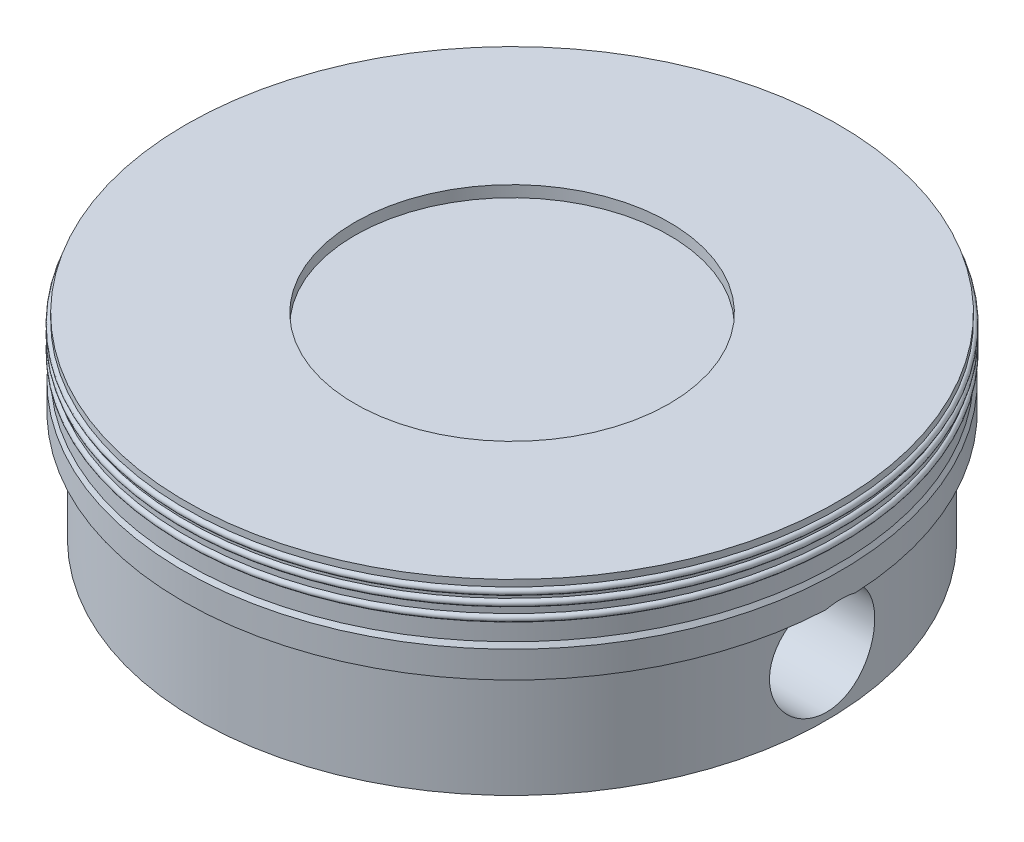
ISO-10303-21;
HEADER;
FILE_DESCRIPTION(('STEP AP214'),'2;1');
FILE_NAME('part.step','',(''),(''),'','','');
FILE_SCHEMA(('AUTOMOTIVE_DESIGN { 1 0 10303 214 1 1 1 1 }'));
ENDSEC;
DATA;
#1=APPLICATION_CONTEXT('core data for automotive mechanical design processes');
#2=APPLICATION_PROTOCOL_DEFINITION('international standard','automotive_design',2000,#1);
#3=PRODUCT_CONTEXT('',#1,'mechanical');
#4=PRODUCT('Part','Part','',(#3));
#5=PRODUCT_RELATED_PRODUCT_CATEGORY('part','',(#4));
#6=PRODUCT_DEFINITION_FORMATION('','',#4);
#7=PRODUCT_DEFINITION_CONTEXT('part definition',#1,'design');
#8=PRODUCT_DEFINITION('design','',#6,#7);
#9=PRODUCT_DEFINITION_SHAPE('','',#8);
#10=(LENGTH_UNIT() NAMED_UNIT(*) SI_UNIT(.MILLI.,.METRE.));
#11=(NAMED_UNIT(*) PLANE_ANGLE_UNIT() SI_UNIT($,.RADIAN.));
#12=(NAMED_UNIT(*) SI_UNIT($,.STERADIAN.) SOLID_ANGLE_UNIT());
#13=UNCERTAINTY_MEASURE_WITH_UNIT(LENGTH_MEASURE(1.E-05),#10,'distance_accuracy_value','');
#14=(GEOMETRIC_REPRESENTATION_CONTEXT(3) GLOBAL_UNCERTAINTY_ASSIGNED_CONTEXT((#13)) GLOBAL_UNIT_ASSIGNED_CONTEXT((#10,
#11,#12)) REPRESENTATION_CONTEXT('',''));
#15=CARTESIAN_POINT('',(0.,0.,0.));
#16=DIRECTION('',(0.,0.,1.));
#17=DIRECTION('',(1.,0.,0.));
#18=AXIS2_PLACEMENT_3D('',#15,#16,#17);
#19=CARTESIAN_POINT('',(0.,1.675,0.));
#20=DIRECTION('',(0.,-1.,0.));
#21=DIRECTION('',(1.,0.,0.));
#22=AXIS2_PLACEMENT_3D('',#19,#20,#21);
#23=PLANE('',#22);
#24=DIRECTION('',(1.,0.,0.));
#25=VECTOR('',#24,1.);
#26=CARTESIAN_POINT('',(-5.01,1.675,-0.222278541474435));
#27=LINE('',#26,#25);
#28=CARTESIAN_POINT('',(-4.99505678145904,1.675,-0.222278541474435));
#29=VERTEX_POINT('',#28);
#30=CARTESIAN_POINT('',(-4.77482902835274,1.675,-0.222278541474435));
#31=VERTEX_POINT('',#30);
#32=EDGE_CURVE('E264',#29,#31,#27,.T.);
#33=ORIENTED_EDGE('',*,*,#32,.F.);
#34=CARTESIAN_POINT('',(0.,1.675,0.));
#35=DIRECTION('',(0.,1.,0.));
#36=DIRECTION('',(-1.,0.,0.));
#37=AXIS2_PLACEMENT_3D('',#34,#35,#36);
#38=CIRCLE('',#37,5.);
#39=CARTESIAN_POINT('',(4.99505678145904,1.675,-0.222278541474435));
#40=VERTEX_POINT('',#39);
#41=EDGE_CURVE('E146',#40,#29,#38,.T.);
#42=ORIENTED_EDGE('',*,*,#41,.F.);
#43=CARTESIAN_POINT('',(4.77482902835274,1.675,-0.222278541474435));
#44=VERTEX_POINT('',#43);
#45=EDGE_CURVE('E60',#44,#40,#27,.T.);
#46=ORIENTED_EDGE('',*,*,#45,.F.);
#47=CARTESIAN_POINT('',(0.,1.675,0.));
#48=DIRECTION('',(0.,1.,0.));
#49=DIRECTION('',(-1.,0.,0.));
#50=AXIS2_PLACEMENT_3D('',#47,#48,#49);
#51=CIRCLE('',#50,4.78);
#52=EDGE_CURVE('E145',#44,#31,#51,.T.);
#53=ORIENTED_EDGE('',*,*,#52,.T.);
#54=EDGE_LOOP('',(#33,#42,#46,#53));
#55=FACE_BOUND('',#54,.T.);
#56=ADVANCED_FACE('F43',(#55),#23,.T.);
#57=CARTESIAN_POINT('',(0.,3.,0.));
#58=DIRECTION('',(0.,1.,0.));
#59=DIRECTION('',(-1.,0.,0.));
#60=AXIS2_PLACEMENT_3D('',#57,#58,#59);
#61=CYLINDRICAL_SURFACE('',#60,3.43);
#62=DIRECTION('',(0.,-1.,0.));
#63=VECTOR('',#62,1.);
#64=CARTESIAN_POINT('',(1.75,2.974,2.94998305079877));
#65=LINE('',#64,#63);
#66=CARTESIAN_POINT('',(1.75,1.93,2.94998305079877));
#67=VERTEX_POINT('',#66);
#68=CARTESIAN_POINT('',(1.75,0.,2.94998305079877));
#69=VERTEX_POINT('',#68);
#70=EDGE_CURVE('E324',#67,#69,#65,.T.);
#71=ORIENTED_EDGE('',*,*,#70,.T.);
#72=CARTESIAN_POINT('',(0.,0.,0.));
#73=DIRECTION('',(0.,1.,0.));
#74=DIRECTION('',(-1.,0.,0.));
#75=AXIS2_PLACEMENT_3D('',#72,#73,#74);
#76=CIRCLE('',#75,3.43);
#77=CARTESIAN_POINT('',(-1.75,0.,2.94998305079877));
#78=VERTEX_POINT('',#77);
#79=EDGE_CURVE('E162',#78,#69,#76,.T.);
#80=ORIENTED_EDGE('',*,*,#79,.F.);
#81=DIRECTION('',(0.,-1.,0.));
#82=VECTOR('',#81,1.);
#83=CARTESIAN_POINT('',(-1.75,2.974,2.94998305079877));
#84=LINE('',#83,#82);
#85=CARTESIAN_POINT('',(-1.75,1.93,2.94998305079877));
#86=VERTEX_POINT('',#85);
#87=EDGE_CURVE('E339',#86,#78,#84,.T.);
#88=ORIENTED_EDGE('',*,*,#87,.F.);
#89=CARTESIAN_POINT('',(0.,1.93,0.));
#90=DIRECTION('',(0.,1.,0.));
#91=DIRECTION('',(-1.,0.,0.));
#92=AXIS2_PLACEMENT_3D('',#89,#90,#91);
#93=CIRCLE('',#92,3.43);
#94=EDGE_CURVE('E167',#86,#67,#93,.T.);
#95=ORIENTED_EDGE('',*,*,#94,.T.);
#96=EDGE_LOOP('',(#71,#80,#88,#95));
#97=FACE_BOUND('',#96,.T.);
#98=ADVANCED_FACE('F212',(#97),#61,.F.);
#99=CARTESIAN_POINT('',(0.,3.,0.));
#100=DIRECTION('',(0.,1.,0.));
#101=DIRECTION('',(-1.,0.,0.));
#102=AXIS2_PLACEMENT_3D('',#99,#100,#101);
#103=CYLINDRICAL_SURFACE('',#102,4.96);
#104=CARTESIAN_POINT('',(0.,2.522,0.));
#105=DIRECTION('',(0.,1.,0.));
#106=DIRECTION('',(-1.,0.,0.));
#107=AXIS2_PLACEMENT_3D('',#104,#105,#106);
#108=CIRCLE('',#107,4.96);
#109=CARTESIAN_POINT('',(-4.96,2.522,0.));
#110=VERTEX_POINT('',#109);
#111=EDGE_CURVE('E362',#110,#110,#108,.T.);
#112=ORIENTED_EDGE('',*,*,#111,.T.);
#113=EDGE_LOOP('',(#112));
#114=FACE_BOUND('',#113,.T.);
#115=CARTESIAN_POINT('',(0.,2.622,0.));
#116=DIRECTION('',(0.,1.,0.));
#117=DIRECTION('',(-1.,0.,0.));
#118=AXIS2_PLACEMENT_3D('',#115,#116,#117);
#119=CIRCLE('',#118,4.96);
#120=CARTESIAN_POINT('',(-4.96,2.622,0.));
#121=VERTEX_POINT('',#120);
#122=EDGE_CURVE('E11',#121,#121,#119,.T.);
#123=ORIENTED_EDGE('',*,*,#122,.F.);
#124=EDGE_LOOP('',(#123));
#125=FACE_BOUND('',#124,.T.);
#126=ADVANCED_FACE('F45',(#114,#125),#103,.T.);
#127=CARTESIAN_POINT('',(0.,2.672,0.));
#128=DIRECTION('',(0.,1.,0.));
#129=DIRECTION('',(-1.,0.,0.));
#130=AXIS2_PLACEMENT_3D('',#127,#128,#129);
#131=TOROIDAL_SURFACE('',#130,4.96,0.0500000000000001);
#132=CARTESIAN_POINT('',(0.,2.722,0.));
#133=DIRECTION('',(0.,1.,0.));
#134=DIRECTION('',(-1.,0.,0.));
#135=AXIS2_PLACEMENT_3D('',#132,#133,#134);
#136=CIRCLE('',#135,4.96);
#137=CARTESIAN_POINT('',(-4.96,2.722,0.));
#138=VERTEX_POINT('',#137);
#139=EDGE_CURVE('E53',#138,#138,#136,.T.);
#140=ORIENTED_EDGE('',*,*,#139,.F.);
#141=EDGE_LOOP('',(#140));
#142=FACE_BOUND('',#141,.T.);
#143=ORIENTED_EDGE('',*,*,#122,.T.);
#144=EDGE_LOOP('',(#143));
#145=FACE_BOUND('',#144,.T.);
#146=ADVANCED_FACE('F206',(#142,#145),#131,.T.);
#147=CARTESIAN_POINT('',(0.,3.,0.));
#148=DIRECTION('',(0.,1.,0.));
#149=DIRECTION('',(-1.,0.,0.));
#150=AXIS2_PLACEMENT_3D('',#147,#148,#149);
#151=CYLINDRICAL_SURFACE('',#150,4.96);
#152=ORIENTED_EDGE('',*,*,#139,.T.);
#153=EDGE_LOOP('',(#152));
#154=FACE_BOUND('',#153,.T.);
#155=CARTESIAN_POINT('',(0.,2.772,0.));
#156=DIRECTION('',(0.,1.,0.));
#157=DIRECTION('',(-1.,0.,0.));
#158=AXIS2_PLACEMENT_3D('',#155,#156,#157);
#159=CIRCLE('',#158,4.96);
#160=CARTESIAN_POINT('',(-4.96,2.772,0.));
#161=VERTEX_POINT('',#160);
#162=EDGE_CURVE('E195',#161,#161,#159,.T.);
#163=ORIENTED_EDGE('',*,*,#162,.F.);
#164=EDGE_LOOP('',(#163));
#165=FACE_BOUND('',#164,.T.);
#166=ADVANCED_FACE('F203',(#154,#165),#151,.T.);
#167=CARTESIAN_POINT('',(0.,2.822,0.));
#168=DIRECTION('',(0.,1.,0.));
#169=DIRECTION('',(-1.,0.,0.));
#170=AXIS2_PLACEMENT_3D('',#167,#168,#169);
#171=TOROIDAL_SURFACE('',#170,4.96,0.0500000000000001);
#172=CARTESIAN_POINT('',(0.,2.872,0.));
#173=DIRECTION('',(0.,1.,0.));
#174=DIRECTION('',(-1.,0.,0.));
#175=AXIS2_PLACEMENT_3D('',#172,#173,#174);
#176=CIRCLE('',#175,4.96);
#177=CARTESIAN_POINT('',(-4.96,2.872,0.));
#178=VERTEX_POINT('',#177);
#179=EDGE_CURVE('E191',#178,#178,#176,.T.);
#180=ORIENTED_EDGE('',*,*,#179,.F.);
#181=EDGE_LOOP('',(#180));
#182=FACE_BOUND('',#181,.T.);
#183=ORIENTED_EDGE('',*,*,#162,.T.);
#184=EDGE_LOOP('',(#183));
#185=FACE_BOUND('',#184,.T.);
#186=ADVANCED_FACE('F426',(#182,#185),#171,.T.);
#187=CARTESIAN_POINT('',(0.,3.,0.));
#188=DIRECTION('',(0.,1.,0.));
#189=DIRECTION('',(-1.,0.,0.));
#190=AXIS2_PLACEMENT_3D('',#187,#188,#189);
#191=CYLINDRICAL_SURFACE('',#190,4.96);
#192=ORIENTED_EDGE('',*,*,#179,.T.);
#193=EDGE_LOOP('',(#192));
#194=FACE_BOUND('',#193,.T.);
#195=CARTESIAN_POINT('',(0.,2.972,0.));
#196=DIRECTION('',(0.,1.,0.));
#197=DIRECTION('',(-1.,0.,0.));
#198=AXIS2_PLACEMENT_3D('',#195,#196,#197);
#199=CIRCLE('',#198,4.96);
#200=CARTESIAN_POINT('',(-4.96,2.972,0.));
#201=VERTEX_POINT('',#200);
#202=EDGE_CURVE('E187',#201,#201,#199,.T.);
#203=ORIENTED_EDGE('',*,*,#202,.F.);
#204=EDGE_LOOP('',(#203));
#205=FACE_BOUND('',#204,.T.);
#206=ADVANCED_FACE('F422',(#194,#205),#191,.T.);
#207=CARTESIAN_POINT('',(0.,2.972,0.));
#208=DIRECTION('',(0.,1.,0.));
#209=DIRECTION('',(-1.,0.,0.));
#210=AXIS2_PLACEMENT_3D('',#207,#208,#209);
#211=PLANE('',#210);
#212=ORIENTED_EDGE('',*,*,#202,.T.);
#213=EDGE_LOOP('',(#212));
#214=FACE_BOUND('',#213,.T.);
#215=CARTESIAN_POINT('',(0.,2.972,0.));
#216=DIRECTION('',(0.,1.,0.));
#217=DIRECTION('',(-1.,0.,0.));
#218=AXIS2_PLACEMENT_3D('',#215,#216,#217);
#219=CIRCLE('',#218,2.39);
#220=CARTESIAN_POINT('',(-2.39,2.972,0.));
#221=VERTEX_POINT('',#220);
#222=EDGE_CURVE('E183',#221,#221,#219,.T.);
#223=ORIENTED_EDGE('',*,*,#222,.F.);
#224=EDGE_LOOP('',(#223));
#225=FACE_BOUND('',#224,.T.);
#226=ADVANCED_FACE('F418',(#214,#225),#211,.T.);
#227=CARTESIAN_POINT('',(0.,3.,0.));
#228=DIRECTION('',(0.,1.,0.));
#229=DIRECTION('',(-1.,0.,0.));
#230=AXIS2_PLACEMENT_3D('',#227,#228,#229);
#231=CYLINDRICAL_SURFACE('',#230,2.39);
#232=ORIENTED_EDGE('',*,*,#222,.T.);
#233=EDGE_LOOP('',(#232));
#234=FACE_BOUND('',#233,.T.);
#235=CARTESIAN_POINT('',(0.,2.8,0.));
#236=DIRECTION('',(0.,1.,0.));
#237=DIRECTION('',(-1.,0.,0.));
#238=AXIS2_PLACEMENT_3D('',#235,#236,#237);
#239=CIRCLE('',#238,2.39);
#240=CARTESIAN_POINT('',(-2.39,2.8,0.));
#241=VERTEX_POINT('',#240);
#242=EDGE_CURVE('E179',#241,#241,#239,.T.);
#243=ORIENTED_EDGE('',*,*,#242,.F.);
#244=EDGE_LOOP('',(#243));
#245=FACE_BOUND('',#244,.T.);
#246=ADVANCED_FACE('F414',(#234,#245),#231,.F.);
#247=CARTESIAN_POINT('',(0.,2.8,0.));
#248=DIRECTION('',(0.,1.,0.));
#249=DIRECTION('',(-1.,0.,0.));
#250=AXIS2_PLACEMENT_3D('',#247,#248,#249);
#251=PLANE('',#250);
#252=ORIENTED_EDGE('',*,*,#242,.T.);
#253=EDGE_LOOP('',(#252));
#254=FACE_BOUND('',#253,.T.);
#255=ADVANCED_FACE('F396',(#254),#251,.T.);
#256=CARTESIAN_POINT('',(0.,2.33,0.));
#257=DIRECTION('',(0.,-1.,0.));
#258=DIRECTION('',(1.,0.,0.));
#259=AXIS2_PLACEMENT_3D('',#256,#257,#258);
#260=PLANE('',#259);
#261=CARTESIAN_POINT('',(0.,2.33,0.));
#262=DIRECTION('',(0.,-1.,0.));
#263=DIRECTION('',(1.,0.,0.));
#264=AXIS2_PLACEMENT_3D('',#261,#262,#263);
#265=CIRCLE('',#264,3.43);
#266=CARTESIAN_POINT('',(1.75,2.33,2.94998305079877));
#267=VERTEX_POINT('',#266);
#268=CARTESIAN_POINT('',(1.75,2.33,-2.94998305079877));
#269=VERTEX_POINT('',#268);
#270=EDGE_CURVE('E320',#267,#269,#265,.F.);
#271=ORIENTED_EDGE('',*,*,#270,.T.);
#272=DIRECTION('',(0.,0.,1.));
#273=VECTOR('',#272,1.);
#274=CARTESIAN_POINT('',(1.75,2.33,2.94998305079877));
#275=LINE('',#274,#273);
#276=EDGE_CURVE('E333',#269,#267,#275,.T.);
#277=ORIENTED_EDGE('',*,*,#276,.T.);
#278=EDGE_LOOP('',(#271,#277));
#279=FACE_BOUND('',#278,.T.);
#280=CARTESIAN_POINT('',(0.,2.33,0.));
#281=DIRECTION('',(0.,-1.,0.));
#282=DIRECTION('',(1.,0.,0.));
#283=AXIS2_PLACEMENT_3D('',#280,#281,#282);
#284=CIRCLE('',#283,3.43);
#285=CARTESIAN_POINT('',(-1.75,2.33,-2.94998305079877));
#286=VERTEX_POINT('',#285);
#287=CARTESIAN_POINT('',(-1.75,2.33,2.94998305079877));
#288=VERTEX_POINT('',#287);
#289=EDGE_CURVE('E357',#286,#288,#284,.F.);
#290=ORIENTED_EDGE('',*,*,#289,.T.);
#291=DIRECTION('',(0.,0.,-1.));
#292=VECTOR('',#291,1.);
#293=CARTESIAN_POINT('',(-1.75,2.33,2.94998305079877));
#294=LINE('',#293,#292);
#295=EDGE_CURVE('E353',#288,#286,#294,.T.);
#296=ORIENTED_EDGE('',*,*,#295,.T.);
#297=EDGE_LOOP('',(#290,#296));
#298=FACE_BOUND('',#297,.T.);
#299=CARTESIAN_POINT('',(0.,2.33,0.));
#300=DIRECTION('',(0.,1.,0.));
#301=DIRECTION('',(-1.,0.,0.));
#302=AXIS2_PLACEMENT_3D('',#299,#300,#301);
#303=CIRCLE('',#302,4.2);
#304=CARTESIAN_POINT('',(-4.2,2.33,0.));
#305=VERTEX_POINT('',#304);
#306=EDGE_CURVE('E175',#305,#305,#303,.T.);
#307=ORIENTED_EDGE('',*,*,#306,.F.);
#308=EDGE_LOOP('',(#307));
#309=FACE_BOUND('',#308,.T.);
#310=ADVANCED_FACE('F392',(#279,#298,#309),#260,.T.);
#311=CARTESIAN_POINT('',(0.,3.,0.));
#312=DIRECTION('',(0.,1.,0.));
#313=DIRECTION('',(-1.,0.,0.));
#314=AXIS2_PLACEMENT_3D('',#311,#312,#313);
#315=CYLINDRICAL_SURFACE('',#314,4.2);
#316=ORIENTED_EDGE('',*,*,#306,.T.);
#317=EDGE_LOOP('',(#316));
#318=FACE_BOUND('',#317,.T.);
#319=CARTESIAN_POINT('',(0.,1.93,0.));
#320=DIRECTION('',(0.,1.,0.));
#321=DIRECTION('',(-1.,0.,0.));
#322=AXIS2_PLACEMENT_3D('',#319,#320,#321);
#323=CIRCLE('',#322,4.2);
#324=CARTESIAN_POINT('',(-4.2,1.93,0.));
#325=VERTEX_POINT('',#324);
#326=EDGE_CURVE('E171',#325,#325,#323,.T.);
#327=ORIENTED_EDGE('',*,*,#326,.F.);
#328=EDGE_LOOP('',(#327));
#329=FACE_BOUND('',#328,.T.);
#330=ADVANCED_FACE('F395',(#318,#329),#315,.F.);
#331=CARTESIAN_POINT('',(0.,1.93,0.));
#332=DIRECTION('',(0.,1.,0.));
#333=DIRECTION('',(-1.,0.,0.));
#334=AXIS2_PLACEMENT_3D('',#331,#332,#333);
#335=PLANE('',#334);
#336=ORIENTED_EDGE('',*,*,#326,.T.);
#337=EDGE_LOOP('',(#336));
#338=FACE_BOUND('',#337,.T.);
#339=ORIENTED_EDGE('',*,*,#94,.F.);
#340=CARTESIAN_POINT('',(0.,1.93,0.));
#341=DIRECTION('',(0.,1.,0.));
#342=DIRECTION('',(-1.,0.,0.));
#343=AXIS2_PLACEMENT_3D('',#340,#341,#342);
#344=CIRCLE('',#343,3.43);
#345=CARTESIAN_POINT('',(-1.75,1.93,-2.94998305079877));
#346=VERTEX_POINT('',#345);
#347=EDGE_CURVE('E356',#346,#86,#344,.T.);
#348=ORIENTED_EDGE('',*,*,#347,.F.);
#349=CARTESIAN_POINT('',(1.75,1.93,-2.94998305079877));
#350=VERTEX_POINT('',#349);
#351=EDGE_CURVE('E166',#350,#346,#93,.T.);
#352=ORIENTED_EDGE('',*,*,#351,.F.);
#353=CARTESIAN_POINT('',(0.,1.93,0.));
#354=DIRECTION('',(0.,1.,0.));
#355=DIRECTION('',(-1.,0.,0.));
#356=AXIS2_PLACEMENT_3D('',#353,#354,#355);
#357=CIRCLE('',#356,3.43);
#358=EDGE_CURVE('E318',#67,#350,#357,.T.);
#359=ORIENTED_EDGE('',*,*,#358,.F.);
#360=EDGE_LOOP('',(#339,#348,#352,#359));
#361=FACE_BOUND('',#360,.T.);
#362=ADVANCED_FACE('F329',(#338,#361),#335,.T.);
#363=DIRECTION('',(0.,-1.,0.));
#364=VECTOR('',#363,1.);
#365=CARTESIAN_POINT('',(1.75,2.974,-2.94998305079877));
#366=LINE('',#365,#364);
#367=CARTESIAN_POINT('',(1.75,0.,-2.94998305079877));
#368=VERTEX_POINT('',#367);
#369=EDGE_CURVE('E561',#350,#368,#366,.T.);
#370=ORIENTED_EDGE('',*,*,#369,.F.);
#371=ORIENTED_EDGE('',*,*,#351,.T.);
#372=DIRECTION('',(0.,-1.,0.));
#373=VECTOR('',#372,1.);
#374=CARTESIAN_POINT('',(-1.75,2.974,-2.94998305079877));
#375=LINE('',#374,#373);
#376=CARTESIAN_POINT('',(-1.75,0.,-2.94998305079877));
#377=VERTEX_POINT('',#376);
#378=EDGE_CURVE('E348',#346,#377,#375,.T.);
#379=ORIENTED_EDGE('',*,*,#378,.T.);
#380=EDGE_CURVE('E161',#368,#377,#76,.T.);
#381=ORIENTED_EDGE('',*,*,#380,.F.);
#382=EDGE_LOOP('',(#370,#371,#379,#381));
#383=FACE_BOUND('',#382,.T.);
#384=ADVANCED_FACE('F219',(#383),#61,.F.);
#385=CARTESIAN_POINT('',(0.,0.,0.));
#386=DIRECTION('',(0.,-1.,0.));
#387=DIRECTION('',(1.,0.,0.));
#388=AXIS2_PLACEMENT_3D('',#385,#386,#387);
#389=PLANE('',#388);
#390=ORIENTED_EDGE('',*,*,#79,.T.);
#391=DIRECTION('',(0.,0.,-1.));
#392=VECTOR('',#391,1.);
#393=CARTESIAN_POINT('',(1.75,0.,2.94998305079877));
#394=LINE('',#393,#392);
#395=EDGE_CURVE('E263',#69,#368,#394,.T.);
#396=ORIENTED_EDGE('',*,*,#395,.T.);
#397=ORIENTED_EDGE('',*,*,#380,.T.);
#398=DIRECTION('',(0.,0.,1.));
#399=VECTOR('',#398,1.);
#400=CARTESIAN_POINT('',(-1.75,0.,2.94998305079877));
#401=LINE('',#400,#399);
#402=EDGE_CURVE('E332',#377,#78,#401,.T.);
#403=ORIENTED_EDGE('',*,*,#402,.T.);
#404=EDGE_LOOP('',(#390,#396,#397,#403));
#405=FACE_BOUND('',#404,.T.);
#406=CARTESIAN_POINT('',(0.,0.,0.));
#407=DIRECTION('',(0.,1.,0.));
#408=DIRECTION('',(-1.,0.,0.));
#409=AXIS2_PLACEMENT_3D('',#406,#407,#408);
#410=CIRCLE('',#409,4.78);
#411=CARTESIAN_POINT('',(-4.78,0.,0.));
#412=VERTEX_POINT('',#411);
#413=EDGE_CURVE('E157',#412,#412,#410,.T.);
#414=ORIENTED_EDGE('',*,*,#413,.F.);
#415=EDGE_LOOP('',(#414));
#416=FACE_BOUND('',#415,.T.);
#417=ADVANCED_FACE('F236',(#405,#416),#389,.T.);
#418=CARTESIAN_POINT('',(0.,3.,0.));
#419=DIRECTION('',(0.,1.,0.));
#420=DIRECTION('',(-1.,0.,0.));
#421=AXIS2_PLACEMENT_3D('',#418,#419,#420);
#422=CYLINDRICAL_SURFACE('',#421,4.78);
#423=CARTESIAN_POINT('',(4.77482902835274,1.675,0.222278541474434));
#424=CARTESIAN_POINT('',(4.77283066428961,1.66251760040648,0.265565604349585));
#425=CARTESIAN_POINT('',(4.77026122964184,1.64632518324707,0.307730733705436));
#426=CARTESIAN_POINT('',(4.76433957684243,1.60716518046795,0.3886797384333));
#427=CARTESIAN_POINT('',(4.76098813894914,1.58420434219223,0.427466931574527));
#428=CARTESIAN_POINT('',(4.75385583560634,1.53212058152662,0.500619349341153));
#429=CARTESIAN_POINT('',(4.75007489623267,1.50299659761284,0.534983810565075));
#430=CARTESIAN_POINT('',(4.74250940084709,1.43940883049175,0.598349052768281));
#431=CARTESIAN_POINT('',(4.73872484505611,1.40494535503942,0.627350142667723));
#432=CARTESIAN_POINT('',(4.73155502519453,1.33141850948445,0.679324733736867));
#433=CARTESIAN_POINT('',(4.72817200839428,1.2923314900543,0.702265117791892));
#434=CARTESIAN_POINT('',(4.72221806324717,1.21079350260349,0.74124709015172));
#435=CARTESIAN_POINT('',(4.71964718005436,1.16834234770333,0.757288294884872));
#436=CARTESIAN_POINT('',(4.71563401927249,1.08161467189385,0.781889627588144));
#437=CARTESIAN_POINT('',(4.71418348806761,1.03735407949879,0.79050452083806));
#438=CARTESIAN_POINT('',(4.7125500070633,0.947995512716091,0.80018577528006));
#439=CARTESIAN_POINT('',(4.71236689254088,0.902897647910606,0.801253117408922));
#440=CARTESIAN_POINT('',(4.71328392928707,0.813698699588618,0.79584005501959));
#441=CARTESIAN_POINT('',(4.71436921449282,0.769592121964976,0.789447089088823));
#442=CARTESIAN_POINT('',(4.71767350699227,0.683088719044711,0.76945319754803));
#443=CARTESIAN_POINT('',(4.71989255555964,0.640691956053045,0.755852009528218));
#444=CARTESIAN_POINT('',(4.72521915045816,0.558683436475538,0.721803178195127));
#445=CARTESIAN_POINT('',(4.7283288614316,0.519078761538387,0.701338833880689));
#446=CARTESIAN_POINT('',(4.73508688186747,0.443840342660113,0.654154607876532));
#447=CARTESIAN_POINT('',(4.73873523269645,0.408206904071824,0.627434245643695));
#448=CARTESIAN_POINT('',(4.74621658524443,0.341444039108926,0.568094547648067));
#449=CARTESIAN_POINT('',(4.75005134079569,0.310377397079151,0.535404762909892));
#450=CARTESIAN_POINT('',(4.7574339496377,0.254152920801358,0.465256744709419));
#451=CARTESIAN_POINT('',(4.76098179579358,0.228995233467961,0.427798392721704));
#452=CARTESIAN_POINT('',(4.76740543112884,0.185232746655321,0.34901358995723));
#453=CARTESIAN_POINT('',(4.77027898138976,0.166649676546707,0.307674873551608));
#454=CARTESIAN_POINT('',(4.77501389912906,0.136709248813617,0.222404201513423));
#455=CARTESIAN_POINT('',(4.77687534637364,0.125351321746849,0.178472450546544));
#456=CARTESIAN_POINT('',(4.77936046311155,0.11029556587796,0.089776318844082));
#457=CARTESIAN_POINT('',(4.77999744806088,0.106515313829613,0.0450263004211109));
#458=CARTESIAN_POINT('',(4.78000253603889,0.106484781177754,-0.0444748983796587));
#459=CARTESIAN_POINT('',(4.77937070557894,0.110234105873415,-0.0892260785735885));
#460=CARTESIAN_POINT('',(4.77691933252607,0.125084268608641,-0.177083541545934));
#461=CARTESIAN_POINT('',(4.77510939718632,0.136125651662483,-0.220200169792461));
#462=CARTESIAN_POINT('',(4.77051005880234,0.165169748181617,-0.303965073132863));
#463=CARTESIAN_POINT('',(4.7677206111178,0.183172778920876,-0.344613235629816));
#464=CARTESIAN_POINT('',(4.76144347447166,0.225773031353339,-0.422610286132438));
#465=CARTESIAN_POINT('',(4.7579509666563,0.250416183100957,-0.459933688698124));
#466=CARTESIAN_POINT('',(4.75066285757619,0.305548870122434,-0.529946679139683));
#467=CARTESIAN_POINT('',(4.74686723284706,0.336038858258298,-0.562635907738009));
#468=CARTESIAN_POINT('',(4.73934595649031,0.402419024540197,-0.622842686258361));
#469=CARTESIAN_POINT('',(4.73562161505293,0.438367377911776,-0.650296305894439));
#470=CARTESIAN_POINT('',(4.72871063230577,0.514408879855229,-0.698783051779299));
#471=CARTESIAN_POINT('',(4.7255239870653,0.554501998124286,-0.719816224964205));
#472=CARTESIAN_POINT('',(4.72006047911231,0.637638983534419,-0.7548139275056));
#473=CARTESIAN_POINT('',(4.71778200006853,0.680677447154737,-0.768791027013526));
#474=CARTESIAN_POINT('',(4.71439384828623,0.768535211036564,-0.789303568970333));
#475=CARTESIAN_POINT('',(4.71328404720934,0.81335431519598,-0.795839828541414));
#476=CARTESIAN_POINT('',(4.71237032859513,0.902894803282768,-0.801232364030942));
#477=CARTESIAN_POINT('',(4.71255007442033,0.947610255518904,-0.800184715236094));
#478=CARTESIAN_POINT('',(4.71415581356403,1.03622268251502,-0.79066917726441));
#479=CARTESIAN_POINT('',(4.71558184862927,1.08011962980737,-0.782201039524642));
#480=CARTESIAN_POINT('',(4.7195083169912,1.16569262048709,-0.758147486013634));
#481=CARTESIAN_POINT('',(4.72200485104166,1.20737611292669,-0.742587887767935));
#482=CARTESIAN_POINT('',(4.72778974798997,1.28754614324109,-0.704817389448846));
#483=CARTESIAN_POINT('',(4.73107806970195,1.32603284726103,-0.682606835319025));
#484=CARTESIAN_POINT('',(4.73812137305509,1.39918330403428,-0.631874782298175));
#485=CARTESIAN_POINT('',(4.74188110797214,1.43380013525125,-0.603286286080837));
#486=CARTESIAN_POINT('',(4.7494215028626,1.49778166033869,-0.540730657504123));
#487=CARTESIAN_POINT('',(4.75320216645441,1.52714541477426,-0.50676256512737));
#488=CARTESIAN_POINT('',(4.76047823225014,1.58065809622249,-0.433176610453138));
#489=CARTESIAN_POINT('',(4.76396027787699,1.6046052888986,-0.393410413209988));
#490=CARTESIAN_POINT('',(4.77010780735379,1.64535476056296,-0.310255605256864));
#491=CARTESIAN_POINT('',(4.77277226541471,1.66214807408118,-0.266862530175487));
#492=CARTESIAN_POINT('',(4.77482902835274,1.675,-0.222278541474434));
#493=B_SPLINE_CURVE_WITH_KNOTS('',3,(#423,#424,#425,#426,#427,#428,#429,#430,#431,#432,#433,
#434,#435,#436,#437,#438,#439,#440,#441,#442,#443,#444,#445,#446,#447,#448,#449,#450,#451,#452,
#453,#454,#455,#456,#457,#458,#459,#460,#461,#462,#463,#464,#465,#466,#467,#468,#469,#470,#471,
#472,#473,#474,#475,#476,#477,#478,#479,#480,#481,#482,#483,#484,#485,#486,#487,#488,#489,#490,
#491,#492),.UNSPECIFIED.,.F.,.F.,(4,2,2,2,2,2,2,2,2,2,2,2,2,2,2,2,2,2,2,2,2,2,2,2,2,2,2,2,2,2,2,
2,2,2,4),(0.,0.135088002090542,0.2700417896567,0.405018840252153,0.539988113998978,
0.675680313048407,0.81138005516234,0.946070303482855,1.08074304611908,1.21385307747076,
1.34696795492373,1.48040913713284,1.61386057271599,1.74900279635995,1.88414837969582,
2.01973654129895,2.15531401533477,2.28940861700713,2.42349618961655,2.55650377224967,
2.68951741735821,2.82347585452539,2.95744467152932,3.09295713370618,3.22846860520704,
3.36373780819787,3.49899215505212,3.63253608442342,3.76608448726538,3.89915052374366,
4.032209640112,4.16673845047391,4.30129129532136,4.44024045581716,4.5793632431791),.UNSPECIFIED.);
#494=CARTESIAN_POINT('',(4.77482902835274,1.675,0.222278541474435));
#495=VERTEX_POINT('',#494);
#496=EDGE_CURVE('E247',#495,#44,#493,.T.);
#497=ORIENTED_EDGE('',*,*,#496,.F.);
#498=CARTESIAN_POINT('',(-4.77482902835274,1.675,0.222278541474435));
#499=VERTEX_POINT('',#498);
#500=EDGE_CURVE('E138',#499,#495,#51,.T.);
#501=ORIENTED_EDGE('',*,*,#500,.F.);
#502=CARTESIAN_POINT('',(-4.77482902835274,1.675,-0.222278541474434));
#503=CARTESIAN_POINT('',(-4.77283066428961,1.66251760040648,-0.265565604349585));
#504=CARTESIAN_POINT('',(-4.77026122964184,1.64632518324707,-0.307730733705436));
#505=CARTESIAN_POINT('',(-4.76433957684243,1.60716518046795,-0.3886797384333));
#506=CARTESIAN_POINT('',(-4.76098813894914,1.58420434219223,-0.427466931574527));
#507=CARTESIAN_POINT('',(-4.75385583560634,1.53212058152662,-0.500619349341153));
#508=CARTESIAN_POINT('',(-4.75007489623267,1.50299659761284,-0.534983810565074));
#509=CARTESIAN_POINT('',(-4.74250940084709,1.43940883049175,-0.598349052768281));
#510=CARTESIAN_POINT('',(-4.73872484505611,1.40494535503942,-0.627350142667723));
#511=CARTESIAN_POINT('',(-4.73155502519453,1.33141850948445,-0.679324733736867));
#512=CARTESIAN_POINT('',(-4.72817200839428,1.2923314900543,-0.702265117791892));
#513=CARTESIAN_POINT('',(-4.72221806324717,1.21079350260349,-0.741247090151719));
#514=CARTESIAN_POINT('',(-4.71964718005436,1.16834234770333,-0.757288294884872));
#515=CARTESIAN_POINT('',(-4.71563401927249,1.08161467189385,-0.781889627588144));
#516=CARTESIAN_POINT('',(-4.71418348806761,1.03735407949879,-0.79050452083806));
#517=CARTESIAN_POINT('',(-4.7125500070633,0.947995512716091,-0.80018577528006));
#518=CARTESIAN_POINT('',(-4.71236689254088,0.902897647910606,-0.801253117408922));
#519=CARTESIAN_POINT('',(-4.71328392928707,0.813698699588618,-0.79584005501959));
#520=CARTESIAN_POINT('',(-4.71436921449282,0.769592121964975,-0.789447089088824));
#521=CARTESIAN_POINT('',(-4.71767350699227,0.683088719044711,-0.76945319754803));
#522=CARTESIAN_POINT('',(-4.71989255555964,0.640691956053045,-0.755852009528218));
#523=CARTESIAN_POINT('',(-4.72521915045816,0.558683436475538,-0.721803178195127));
#524=CARTESIAN_POINT('',(-4.7283288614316,0.519078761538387,-0.701338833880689));
#525=CARTESIAN_POINT('',(-4.73508688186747,0.443840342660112,-0.654154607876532));
#526=CARTESIAN_POINT('',(-4.73873523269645,0.408206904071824,-0.627434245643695));
#527=CARTESIAN_POINT('',(-4.74621658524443,0.341444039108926,-0.568094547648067));
#528=CARTESIAN_POINT('',(-4.75005134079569,0.310377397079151,-0.535404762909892));
#529=CARTESIAN_POINT('',(-4.7574339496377,0.254152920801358,-0.465256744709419));
#530=CARTESIAN_POINT('',(-4.76098179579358,0.22899523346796,-0.427798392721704));
#531=CARTESIAN_POINT('',(-4.76740543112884,0.185232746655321,-0.34901358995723));
#532=CARTESIAN_POINT('',(-4.77027898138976,0.166649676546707,-0.307674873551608));
#533=CARTESIAN_POINT('',(-4.77501389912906,0.136709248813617,-0.222404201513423));
#534=CARTESIAN_POINT('',(-4.77687534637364,0.125351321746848,-0.178472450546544));
#535=CARTESIAN_POINT('',(-4.77936046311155,0.11029556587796,-0.0897763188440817));
#536=CARTESIAN_POINT('',(-4.77999744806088,0.106515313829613,-0.0450263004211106));
#537=CARTESIAN_POINT('',(-4.78000253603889,0.106484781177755,0.0444748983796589));
#538=CARTESIAN_POINT('',(-4.77937070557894,0.110234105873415,0.0892260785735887));
#539=CARTESIAN_POINT('',(-4.77691933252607,0.125084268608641,0.177083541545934));
#540=CARTESIAN_POINT('',(-4.77510939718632,0.136125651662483,0.220200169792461));
#541=CARTESIAN_POINT('',(-4.77051005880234,0.165169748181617,0.303965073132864));
#542=CARTESIAN_POINT('',(-4.7677206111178,0.183172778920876,0.344613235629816));
#543=CARTESIAN_POINT('',(-4.76144347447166,0.225773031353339,0.422610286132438));
#544=CARTESIAN_POINT('',(-4.7579509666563,0.250416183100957,0.459933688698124));
#545=CARTESIAN_POINT('',(-4.75066285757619,0.305548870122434,0.529946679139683));
#546=CARTESIAN_POINT('',(-4.74686723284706,0.336038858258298,0.562635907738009));
#547=CARTESIAN_POINT('',(-4.73934595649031,0.402419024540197,0.62284268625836));
#548=CARTESIAN_POINT('',(-4.73562161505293,0.438367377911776,0.650296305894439));
#549=CARTESIAN_POINT('',(-4.72871063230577,0.514408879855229,0.698783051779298));
#550=CARTESIAN_POINT('',(-4.7255239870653,0.554501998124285,0.719816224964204));
#551=CARTESIAN_POINT('',(-4.72006047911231,0.637638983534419,0.7548139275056));
#552=CARTESIAN_POINT('',(-4.71778200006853,0.680677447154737,0.768791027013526));
#553=CARTESIAN_POINT('',(-4.71439384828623,0.768535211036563,0.789303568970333));
#554=CARTESIAN_POINT('',(-4.71328404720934,0.81335431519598,0.795839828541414));
#555=CARTESIAN_POINT('',(-4.71237032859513,0.902894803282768,0.801232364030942));
#556=CARTESIAN_POINT('',(-4.71255007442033,0.947610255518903,0.800184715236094));
#557=CARTESIAN_POINT('',(-4.71415581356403,1.03622268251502,0.79066917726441));
#558=CARTESIAN_POINT('',(-4.71558184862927,1.08011962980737,0.782201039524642));
#559=CARTESIAN_POINT('',(-4.7195083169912,1.16569262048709,0.758147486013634));
#560=CARTESIAN_POINT('',(-4.72200485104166,1.20737611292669,0.742587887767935));
#561=CARTESIAN_POINT('',(-4.72778974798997,1.28754614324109,0.704817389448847));
#562=CARTESIAN_POINT('',(-4.73107806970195,1.32603284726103,0.682606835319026));
#563=CARTESIAN_POINT('',(-4.73812137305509,1.39918330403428,0.631874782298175));
#564=CARTESIAN_POINT('',(-4.74188110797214,1.43380013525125,0.603286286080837));
#565=CARTESIAN_POINT('',(-4.7494215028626,1.49778166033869,0.540730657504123));
#566=CARTESIAN_POINT('',(-4.75320216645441,1.52714541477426,0.50676256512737));
#567=CARTESIAN_POINT('',(-4.76047823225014,1.58065809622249,0.433176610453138));
#568=CARTESIAN_POINT('',(-4.76396027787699,1.6046052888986,0.393410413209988));
#569=CARTESIAN_POINT('',(-4.77010780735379,1.64535476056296,0.310255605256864));
#570=CARTESIAN_POINT('',(-4.77277226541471,1.66214807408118,0.266862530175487));
#571=CARTESIAN_POINT('',(-4.77482902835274,1.675,0.222278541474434));
#572=B_SPLINE_CURVE_WITH_KNOTS('',3,(#502,#503,#504,#505,#506,#507,#508,#509,#510,#511,#512,
#513,#514,#515,#516,#517,#518,#519,#520,#521,#522,#523,#524,#525,#526,#527,#528,#529,#530,#531,
#532,#533,#534,#535,#536,#537,#538,#539,#540,#541,#542,#543,#544,#545,#546,#547,#548,#549,#550,
#551,#552,#553,#554,#555,#556,#557,#558,#559,#560,#561,#562,#563,#564,#565,#566,#567,#568,#569,
#570,#571),.UNSPECIFIED.,.F.,.F.,(4,2,2,2,2,2,2,2,2,2,2,2,2,2,2,2,2,2,2,2,2,2,2,2,2,2,2,2,2,2,2,
2,2,2,4),(0.,0.135088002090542,0.2700417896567,0.405018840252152,0.539988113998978,
0.675680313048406,0.811380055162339,0.946070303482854,1.08074304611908,1.21385307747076,
1.34696795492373,1.48040913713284,1.61386057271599,1.74900279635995,1.88414837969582,
2.01973654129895,2.15531401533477,2.28940861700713,2.42349618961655,2.55650377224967,
2.68951741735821,2.82347585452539,2.95744467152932,3.09295713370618,3.22846860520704,
3.36373780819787,3.49899215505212,3.63253608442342,3.76608448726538,3.89915052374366,
4.032209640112,4.16673845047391,4.30129129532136,4.44024045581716,4.5793632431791),.UNSPECIFIED.);
#573=EDGE_CURVE('E256',#31,#499,#572,.T.);
#574=ORIENTED_EDGE('',*,*,#573,.F.);
#575=ORIENTED_EDGE('',*,*,#52,.F.);
#576=EDGE_LOOP('',(#497,#501,#574,#575));
#577=FACE_BOUND('',#576,.T.);
#578=ORIENTED_EDGE('',*,*,#413,.T.);
#579=EDGE_LOOP('',(#578));
#580=FACE_BOUND('',#579,.T.);
#581=ADVANCED_FACE('F230',(#577,#580),#422,.T.);
#582=DIRECTION('',(1.,0.,0.));
#583=VECTOR('',#582,1.);
#584=CARTESIAN_POINT('',(-5.01,1.675,0.222278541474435));
#585=LINE('',#584,#583);
#586=CARTESIAN_POINT('',(4.99505678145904,1.675,0.222278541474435));
#587=VERTEX_POINT('',#586);
#588=EDGE_CURVE('E123',#587,#495,#585,.F.);
#589=ORIENTED_EDGE('',*,*,#588,.F.);
#590=CARTESIAN_POINT('',(-4.99505678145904,1.675,0.222278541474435));
#591=VERTEX_POINT('',#590);
#592=EDGE_CURVE('E136',#591,#587,#38,.T.);
#593=ORIENTED_EDGE('',*,*,#592,.F.);
#594=EDGE_CURVE('E68',#499,#591,#585,.F.);
#595=ORIENTED_EDGE('',*,*,#594,.F.);
#596=ORIENTED_EDGE('',*,*,#500,.T.);
#597=EDGE_LOOP('',(#589,#593,#595,#596));
#598=FACE_BOUND('',#597,.T.);
#599=ADVANCED_FACE('F135',(#598),#23,.T.);
#600=CARTESIAN_POINT('',(0.,3.,0.));
#601=DIRECTION('',(0.,1.,0.));
#602=DIRECTION('',(-1.,0.,0.));
#603=AXIS2_PLACEMENT_3D('',#600,#601,#602);
#604=CYLINDRICAL_SURFACE('',#603,5.);
#605=CARTESIAN_POINT('',(-4.99505678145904,1.675,0.222278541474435));
#606=CARTESIAN_POINT('',(-4.99601924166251,1.68125091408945,0.20066478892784));
#607=CARTESIAN_POINT('',(-4.99685104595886,1.6865884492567,0.178793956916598));
#608=CARTESIAN_POINT('',(-4.99823482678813,1.6954053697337,0.134667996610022));
#609=CARTESIAN_POINT('',(-4.99878675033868,1.69888440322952,0.11241279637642));
#610=CARTESIAN_POINT('',(-4.99997478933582,1.7063599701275,0.0463702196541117));
#611=CARTESIAN_POINT('',(-5.00019162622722,1.70770103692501,0.00223735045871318));
#612=CARTESIAN_POINT('',(-4.99957415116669,1.70383490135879,-0.0719867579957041));
#613=CARTESIAN_POINT('',(-4.99904417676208,1.70052454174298,-0.102199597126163));
#614=CARTESIAN_POINT('',(-4.9974509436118,1.69042173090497,-0.162537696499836));
#615=CARTESIAN_POINT('',(-4.99637901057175,1.68357259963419,-0.192653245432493));
#616=CARTESIAN_POINT('',(-4.99505678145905,1.675,-0.222278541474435));
#617=B_SPLINE_CURVE_WITH_KNOTS('',3,(#605,#606,#607,#608,#609,#610,#611,#612,#613,#614,#615,
#616),.UNSPECIFIED.,.F.,.F.,(4,2,2,2,2,4),(0.,0.0675150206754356,0.13504281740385,
0.266802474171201,0.357814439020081,0.450331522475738),.UNSPECIFIED.);
#618=EDGE_CURVE('E143',#591,#29,#617,.T.);
#619=ORIENTED_EDGE('',*,*,#618,.F.);
#620=ORIENTED_EDGE('',*,*,#592,.T.);
#621=CARTESIAN_POINT('',(4.99505678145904,1.675,-0.222278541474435));
#622=CARTESIAN_POINT('',(4.99601924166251,1.68125091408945,-0.20066478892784));
#623=CARTESIAN_POINT('',(4.99685104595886,1.6865884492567,-0.178793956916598));
#624=CARTESIAN_POINT('',(4.99823482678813,1.6954053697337,-0.134667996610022));
#625=CARTESIAN_POINT('',(4.99878675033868,1.69888440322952,-0.11241279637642));
#626=CARTESIAN_POINT('',(4.99997478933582,1.7063599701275,-0.0463702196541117));
#627=CARTESIAN_POINT('',(5.00019162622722,1.70770103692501,-0.00223735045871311));
#628=CARTESIAN_POINT('',(4.99957415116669,1.70383490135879,0.0719867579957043));
#629=CARTESIAN_POINT('',(4.99904417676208,1.70052454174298,0.102199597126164));
#630=CARTESIAN_POINT('',(4.9974509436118,1.69042173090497,0.162537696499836));
#631=CARTESIAN_POINT('',(4.99637901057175,1.68357259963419,0.192653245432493));
#632=CARTESIAN_POINT('',(4.99505678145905,1.675,0.222278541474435));
#633=B_SPLINE_CURVE_WITH_KNOTS('',3,(#621,#622,#623,#624,#625,#626,#627,#628,#629,#630,#631,
#632),.UNSPECIFIED.,.F.,.F.,(4,2,2,2,2,4),(0.,0.0675150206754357,0.135042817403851,
0.266802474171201,0.357814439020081,0.450331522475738),.UNSPECIFIED.);
#634=EDGE_CURVE('E119',#40,#587,#633,.T.);
#635=ORIENTED_EDGE('',*,*,#634,.F.);
#636=ORIENTED_EDGE('',*,*,#41,.T.);
#637=EDGE_LOOP('',(#619,#620,#635,#636));
#638=FACE_BOUND('',#637,.T.);
#639=CARTESIAN_POINT('',(0.,2.08067161,0.));
#640=DIRECTION('',(0.,1.,0.));
#641=DIRECTION('',(-1.,0.,0.));
#642=AXIS2_PLACEMENT_3D('',#639,#640,#641);
#643=CIRCLE('',#642,5.);
#644=CARTESIAN_POINT('',(-5.,2.08067161,0.));
#645=VERTEX_POINT('',#644);
#646=EDGE_CURVE('E152',#645,#645,#643,.T.);
#647=ORIENTED_EDGE('',*,*,#646,.F.);
#648=EDGE_LOOP('',(#647));
#649=FACE_BOUND('',#648,.T.);
#650=ADVANCED_FACE('F141',(#638,#649),#604,.T.);
#651=CARTESIAN_POINT('',(0.,2.15067161,0.));
#652=DIRECTION('',(0.,-1.,0.));
#653=DIRECTION('',(1.,0.,0.));
#654=AXIS2_PLACEMENT_3D('',#651,#652,#653);
#655=CONICAL_SURFACE('',#654,4.96,0.519146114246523);
#656=ORIENTED_EDGE('',*,*,#646,.T.);
#657=EDGE_LOOP('',(#656));
#658=FACE_BOUND('',#657,.T.);
#659=CARTESIAN_POINT('',(0.,2.15067161,0.));
#660=DIRECTION('',(0.,1.,0.));
#661=DIRECTION('',(-1.,0.,0.));
#662=AXIS2_PLACEMENT_3D('',#659,#660,#661);
#663=CIRCLE('',#662,4.96);
#664=CARTESIAN_POINT('',(-4.96,2.15067161,0.));
#665=VERTEX_POINT('',#664);
#666=EDGE_CURVE('E368',#665,#665,#663,.T.);
#667=ORIENTED_EDGE('',*,*,#666,.F.);
#668=EDGE_LOOP('',(#667));
#669=FACE_BOUND('',#668,.T.);
#670=ADVANCED_FACE('F235',(#658,#669),#655,.T.);
#671=CARTESIAN_POINT('',(0.,3.,0.));
#672=DIRECTION('',(0.,1.,0.));
#673=DIRECTION('',(-1.,0.,0.));
#674=AXIS2_PLACEMENT_3D('',#671,#672,#673);
#675=CYLINDRICAL_SURFACE('',#674,4.96);
#676=ORIENTED_EDGE('',*,*,#666,.T.);
#677=EDGE_LOOP('',(#676));
#678=FACE_BOUND('',#677,.T.);
#679=CARTESIAN_POINT('',(0.,2.422,0.));
#680=DIRECTION('',(0.,1.,0.));
#681=DIRECTION('',(-1.,0.,0.));
#682=AXIS2_PLACEMENT_3D('',#679,#680,#681);
#683=CIRCLE('',#682,4.96);
#684=CARTESIAN_POINT('',(-4.96,2.422,0.));
#685=VERTEX_POINT('',#684);
#686=EDGE_CURVE('E365',#685,#685,#683,.T.);
#687=ORIENTED_EDGE('',*,*,#686,.F.);
#688=EDGE_LOOP('',(#687));
#689=FACE_BOUND('',#688,.T.);
#690=ADVANCED_FACE('F290',(#678,#689),#675,.T.);
#691=CARTESIAN_POINT('',(0.,2.472,0.));
#692=DIRECTION('',(0.,1.,0.));
#693=DIRECTION('',(-1.,0.,0.));
#694=AXIS2_PLACEMENT_3D('',#691,#692,#693);
#695=TOROIDAL_SURFACE('',#694,4.96,0.0500000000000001);
#696=ORIENTED_EDGE('',*,*,#111,.F.);
#697=EDGE_LOOP('',(#696));
#698=FACE_BOUND('',#697,.T.);
#699=ORIENTED_EDGE('',*,*,#686,.T.);
#700=EDGE_LOOP('',(#699));
#701=FACE_BOUND('',#700,.T.);
#702=ADVANCED_FACE('F294',(#698,#701),#695,.T.);
#703=CARTESIAN_POINT('',(0.,2.974,0.));
#704=DIRECTION('',(0.,-1.,0.));
#705=DIRECTION('',(1.,0.,0.));
#706=AXIS2_PLACEMENT_3D('',#703,#704,#705);
#707=CYLINDRICAL_SURFACE('',#706,3.43);
#708=EDGE_CURVE('E352',#286,#346,#375,.T.);
#709=ORIENTED_EDGE('',*,*,#708,.T.);
#710=ORIENTED_EDGE('',*,*,#347,.T.);
#711=EDGE_CURVE('E344',#288,#86,#84,.T.);
#712=ORIENTED_EDGE('',*,*,#711,.F.);
#713=ORIENTED_EDGE('',*,*,#289,.F.);
#714=EDGE_LOOP('',(#709,#710,#712,#713));
#715=FACE_BOUND('',#714,.T.);
#716=ADVANCED_FACE('F298',(#715),#707,.T.);
#717=CARTESIAN_POINT('',(-1.75,2.974,2.94998305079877));
#718=DIRECTION('',(1.,0.,0.));
#719=DIRECTION('',(0.,1.,0.));
#720=AXIS2_PLACEMENT_3D('',#717,#718,#719);
#721=PLANE('',#720);
#722=CARTESIAN_POINT('',(-1.75,0.906500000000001,0.));
#723=DIRECTION('',(1.,0.,0.));
#724=DIRECTION('',(0.,1.,0.));
#725=AXIS2_PLACEMENT_3D('',#722,#723,#724);
#726=CIRCLE('',#725,0.8);
#727=CARTESIAN_POINT('',(-1.75,1.7065,0.));
#728=VERTEX_POINT('',#727);
#729=EDGE_CURVE('E130',#728,#728,#726,.T.);
#730=ORIENTED_EDGE('',*,*,#729,.F.);
#731=EDGE_LOOP('',(#730));
#732=FACE_BOUND('',#731,.T.);
#733=ORIENTED_EDGE('',*,*,#295,.F.);
#734=ORIENTED_EDGE('',*,*,#711,.T.);
#735=ORIENTED_EDGE('',*,*,#87,.T.);
#736=ORIENTED_EDGE('',*,*,#402,.F.);
#737=ORIENTED_EDGE('',*,*,#378,.F.);
#738=ORIENTED_EDGE('',*,*,#708,.F.);
#739=EDGE_LOOP('',(#733,#734,#735,#736,#737,#738));
#740=FACE_BOUND('',#739,.T.);
#741=ADVANCED_FACE('F300',(#732,#740),#721,.T.);
#742=CARTESIAN_POINT('',(0.,2.974,0.));
#743=DIRECTION('',(0.,-1.,0.));
#744=DIRECTION('',(1.,0.,0.));
#745=AXIS2_PLACEMENT_3D('',#742,#743,#744);
#746=CYLINDRICAL_SURFACE('',#745,3.43);
#747=EDGE_CURVE('E315',#267,#67,#65,.T.);
#748=ORIENTED_EDGE('',*,*,#747,.T.);
#749=ORIENTED_EDGE('',*,*,#358,.T.);
#750=EDGE_CURVE('E557',#269,#350,#366,.T.);
#751=ORIENTED_EDGE('',*,*,#750,.F.);
#752=ORIENTED_EDGE('',*,*,#270,.F.);
#753=EDGE_LOOP('',(#748,#749,#751,#752));
#754=FACE_BOUND('',#753,.T.);
#755=ADVANCED_FACE('F275',(#754),#746,.T.);
#756=CARTESIAN_POINT('',(1.75,2.974,2.94998305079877));
#757=DIRECTION('',(-1.,0.,0.));
#758=DIRECTION('',(0.,-1.,0.));
#759=AXIS2_PLACEMENT_3D('',#756,#757,#758);
#760=PLANE('',#759);
#761=CARTESIAN_POINT('',(1.75,0.906500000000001,0.));
#762=DIRECTION('',(-1.,0.,0.));
#763=DIRECTION('',(0.,-1.,0.));
#764=AXIS2_PLACEMENT_3D('',#761,#762,#763);
#765=CIRCLE('',#764,0.8);
#766=CARTESIAN_POINT('',(1.75,0.106500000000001,0.));
#767=VERTEX_POINT('',#766);
#768=EDGE_CURVE('E47',#767,#767,#765,.T.);
#769=ORIENTED_EDGE('',*,*,#768,.F.);
#770=EDGE_LOOP('',(#769));
#771=FACE_BOUND('',#770,.T.);
#772=ORIENTED_EDGE('',*,*,#276,.F.);
#773=ORIENTED_EDGE('',*,*,#750,.T.);
#774=ORIENTED_EDGE('',*,*,#369,.T.);
#775=ORIENTED_EDGE('',*,*,#395,.F.);
#776=ORIENTED_EDGE('',*,*,#70,.F.);
#777=ORIENTED_EDGE('',*,*,#747,.F.);
#778=EDGE_LOOP('',(#772,#773,#774,#775,#776,#777));
#779=FACE_BOUND('',#778,.T.);
#780=ADVANCED_FACE('F274',(#771,#779),#760,.T.);
#781=CARTESIAN_POINT('',(-5.01,0.906500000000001,0.));
#782=DIRECTION('',(1.,0.,0.));
#783=DIRECTION('',(0.,0.,-1.));
#784=AXIS2_PLACEMENT_3D('',#781,#782,#783);
#785=CYLINDRICAL_SURFACE('',#784,0.8);
#786=ORIENTED_EDGE('',*,*,#496,.T.);
#787=ORIENTED_EDGE('',*,*,#45,.T.);
#788=ORIENTED_EDGE('',*,*,#634,.T.);
#789=ORIENTED_EDGE('',*,*,#588,.T.);
#790=EDGE_LOOP('',(#786,#787,#788,#789));
#791=FACE_BOUND('',#790,.T.);
#792=ORIENTED_EDGE('',*,*,#768,.T.);
#793=EDGE_LOOP('',(#792));
#794=FACE_BOUND('',#793,.T.);
#795=ADVANCED_FACE('F121',(#791,#794),#785,.F.);
#796=ORIENTED_EDGE('',*,*,#573,.T.);
#797=ORIENTED_EDGE('',*,*,#594,.T.);
#798=ORIENTED_EDGE('',*,*,#618,.T.);
#799=ORIENTED_EDGE('',*,*,#32,.T.);
#800=EDGE_LOOP('',(#796,#797,#798,#799));
#801=FACE_BOUND('',#800,.T.);
#802=ORIENTED_EDGE('',*,*,#729,.T.);
#803=EDGE_LOOP('',(#802));
#804=FACE_BOUND('',#803,.T.);
#805=ADVANCED_FACE('F273',(#801,#804),#785,.F.);
#806=CLOSED_SHELL('',(#56,#98,#126,#146,#166,#186,#206,#226,#246,#255,#310,#330,#362,#384,#417,
#581,#599,#650,#670,#690,#702,#716,#741,#755,#780,#795,#805));
#807=MANIFOLD_SOLID_BREP('B2',#806);
#808=ADVANCED_BREP_SHAPE_REPRESENTATION('',(#18,#807),#14);
#809=SHAPE_DEFINITION_REPRESENTATION(#9,#808);
ENDSEC;
END-ISO-10303-21;
